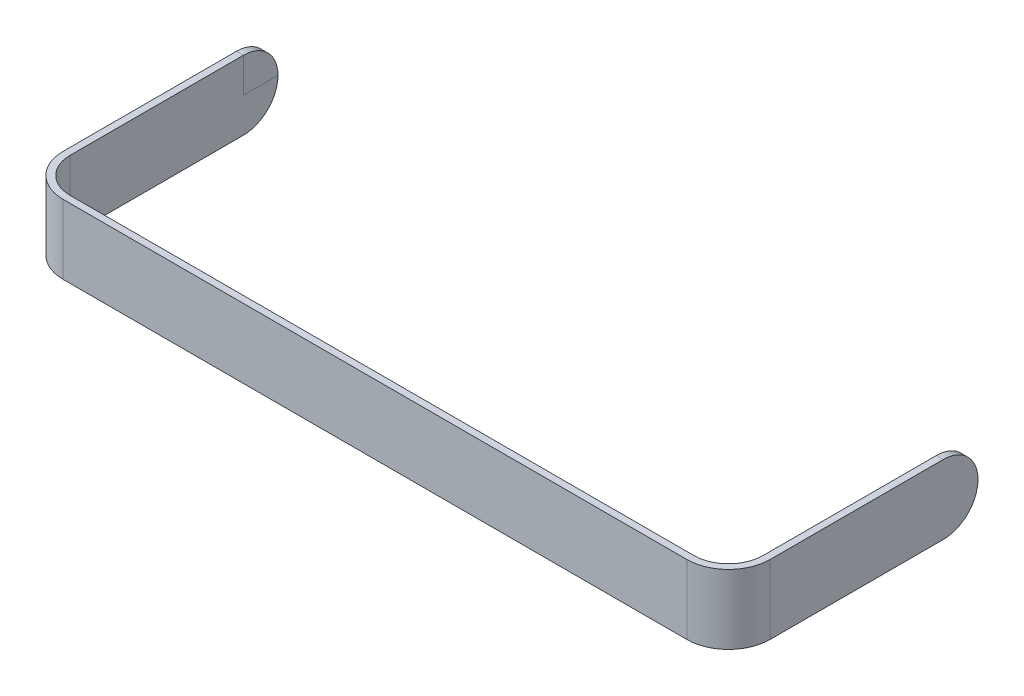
ISO-10303-21;
HEADER;
FILE_DESCRIPTION(('STEP AP214'),'2;1');
FILE_NAME('part.step','',(''),(''),'','','');
FILE_SCHEMA(('AUTOMOTIVE_DESIGN { 1 0 10303 214 1 1 1 1 }'));
ENDSEC;
DATA;
#1=APPLICATION_CONTEXT('core data for automotive mechanical design processes');
#2=APPLICATION_PROTOCOL_DEFINITION('international standard','automotive_design',2000,#1);
#3=PRODUCT_CONTEXT('',#1,'mechanical');
#4=PRODUCT('Part','Part','',(#3));
#5=PRODUCT_RELATED_PRODUCT_CATEGORY('part','',(#4));
#6=PRODUCT_DEFINITION_FORMATION('','',#4);
#7=PRODUCT_DEFINITION_CONTEXT('part definition',#1,'design');
#8=PRODUCT_DEFINITION('design','',#6,#7);
#9=PRODUCT_DEFINITION_SHAPE('','',#8);
#10=(LENGTH_UNIT() NAMED_UNIT(*) SI_UNIT(.MILLI.,.METRE.));
#11=(NAMED_UNIT(*) PLANE_ANGLE_UNIT() SI_UNIT($,.RADIAN.));
#12=(NAMED_UNIT(*) SI_UNIT($,.STERADIAN.) SOLID_ANGLE_UNIT());
#13=UNCERTAINTY_MEASURE_WITH_UNIT(LENGTH_MEASURE(1.E-05),#10,'distance_accuracy_value','');
#14=(GEOMETRIC_REPRESENTATION_CONTEXT(3) GLOBAL_UNCERTAINTY_ASSIGNED_CONTEXT((#13)) GLOBAL_UNIT_ASSIGNED_CONTEXT((#10,
#11,#12)) REPRESENTATION_CONTEXT('',''));
#15=CARTESIAN_POINT('',(0.,0.,0.));
#16=DIRECTION('',(0.,0.,1.));
#17=DIRECTION('',(1.,0.,0.));
#18=AXIS2_PLACEMENT_3D('',#15,#16,#17);
#19=CARTESIAN_POINT('',(-500.,50.,-50.));
#20=DIRECTION('',(-1.,0.,0.));
#21=DIRECTION('',(0.,0.,1.));
#22=AXIS2_PLACEMENT_3D('',#19,#20,#21);
#23=PLANE('',#22);
#24=DIRECTION('',(0.,0.,-1.));
#25=VECTOR('',#24,1.);
#26=CARTESIAN_POINT('',(-500.,0.,-50.));
#27=LINE('',#26,#25);
#28=CARTESIAN_POINT('',(-500.,0.,-300.));
#29=VERTEX_POINT('',#28);
#30=CARTESIAN_POINT('',(-500.,0.,-350.));
#31=VERTEX_POINT('',#30);
#32=EDGE_CURVE('E11',#29,#31,#27,.T.);
#33=ORIENTED_EDGE('',*,*,#32,.F.);
#34=DIRECTION('',(0.,-1.,0.));
#35=VECTOR('',#34,1.);
#36=CARTESIAN_POINT('',(-500.,50.,-300.));
#37=LINE('',#36,#35);
#38=CARTESIAN_POINT('',(-500.,50.,-300.));
#39=VERTEX_POINT('',#38);
#40=EDGE_CURVE('E40',#39,#29,#37,.T.);
#41=ORIENTED_EDGE('',*,*,#40,.F.);
#42=DIRECTION('',(0.,0.,-1.));
#43=VECTOR('',#42,1.);
#44=CARTESIAN_POINT('',(-500.,50.,-50.));
#45=LINE('',#44,#43);
#46=CARTESIAN_POINT('',(-500.,50.,-50.));
#47=VERTEX_POINT('',#46);
#48=EDGE_CURVE('E229',#47,#39,#45,.T.);
#49=ORIENTED_EDGE('',*,*,#48,.F.);
#50=DIRECTION('',(0.,-1.,0.));
#51=VECTOR('',#50,1.);
#52=CARTESIAN_POINT('',(-500.,50.,-50.));
#53=LINE('',#52,#51);
#54=CARTESIAN_POINT('',(-500.,-50.,-50.));
#55=VERTEX_POINT('',#54);
#56=EDGE_CURVE('E204',#47,#55,#53,.T.);
#57=ORIENTED_EDGE('',*,*,#56,.T.);
#58=DIRECTION('',(0.,0.,-1.));
#59=VECTOR('',#58,1.);
#60=CARTESIAN_POINT('',(-500.,-50.,-50.));
#61=LINE('',#60,#59);
#62=CARTESIAN_POINT('',(-500.,-50.,-300.));
#63=VERTEX_POINT('',#62);
#64=EDGE_CURVE('E176',#55,#63,#61,.T.);
#65=ORIENTED_EDGE('',*,*,#64,.T.);
#66=CARTESIAN_POINT('',(-500.,0.,-300.));
#67=DIRECTION('',(1.,0.,0.));
#68=DIRECTION('',(0.,0.,-1.));
#69=AXIS2_PLACEMENT_3D('',#66,#67,#68);
#70=CIRCLE('',#69,50.);
#71=EDGE_CURVE('E165',#63,#31,#70,.T.);
#72=ORIENTED_EDGE('',*,*,#71,.T.);
#73=EDGE_LOOP('',(#33,#41,#49,#57,#65,#72));
#74=FACE_BOUND('',#73,.T.);
#75=ADVANCED_FACE('F36',(#74),#23,.F.);
#76=CARTESIAN_POINT('',(500.,50.,-50.));
#77=DIRECTION('',(1.,0.,0.));
#78=DIRECTION('',(0.,0.,-1.));
#79=AXIS2_PLACEMENT_3D('',#76,#77,#78);
#80=PLANE('',#79);
#81=DIRECTION('',(0.,0.,1.));
#82=VECTOR('',#81,1.);
#83=CARTESIAN_POINT('',(500.,0.,-50.));
#84=LINE('',#83,#82);
#85=CARTESIAN_POINT('',(500.,0.,-350.));
#86=VERTEX_POINT('',#85);
#87=CARTESIAN_POINT('',(500.,0.,-300.));
#88=VERTEX_POINT('',#87);
#89=EDGE_CURVE('E141',#86,#88,#84,.T.);
#90=ORIENTED_EDGE('',*,*,#89,.F.);
#91=CARTESIAN_POINT('',(500.,0.,-300.));
#92=DIRECTION('',(-1.,0.,0.));
#93=DIRECTION('',(0.,0.,1.));
#94=AXIS2_PLACEMENT_3D('',#91,#92,#93);
#95=CIRCLE('',#94,50.);
#96=CARTESIAN_POINT('',(500.,-50.,-300.));
#97=VERTEX_POINT('',#96);
#98=EDGE_CURVE('E134',#86,#97,#95,.T.);
#99=ORIENTED_EDGE('',*,*,#98,.T.);
#100=DIRECTION('',(0.,0.,1.));
#101=VECTOR('',#100,1.);
#102=CARTESIAN_POINT('',(500.,-50.,-50.));
#103=LINE('',#102,#101);
#104=CARTESIAN_POINT('',(500.,-50.,-50.));
#105=VERTEX_POINT('',#104);
#106=EDGE_CURVE('E138',#97,#105,#103,.T.);
#107=ORIENTED_EDGE('',*,*,#106,.T.);
#108=DIRECTION('',(0.,-1.,0.));
#109=VECTOR('',#108,1.);
#110=CARTESIAN_POINT('',(500.,50.,-50.));
#111=LINE('',#110,#109);
#112=CARTESIAN_POINT('',(500.,50.,-50.));
#113=VERTEX_POINT('',#112);
#114=EDGE_CURVE('E213',#113,#105,#111,.T.);
#115=ORIENTED_EDGE('',*,*,#114,.F.);
#116=DIRECTION('',(0.,0.,1.));
#117=VECTOR('',#116,1.);
#118=CARTESIAN_POINT('',(500.,50.,-50.));
#119=LINE('',#118,#117);
#120=CARTESIAN_POINT('',(500.,50.,-300.));
#121=VERTEX_POINT('',#120);
#122=EDGE_CURVE('E256',#121,#113,#119,.T.);
#123=ORIENTED_EDGE('',*,*,#122,.F.);
#124=DIRECTION('',(0.,1.,0.));
#125=VECTOR('',#124,1.);
#126=CARTESIAN_POINT('',(500.,50.,-300.));
#127=LINE('',#126,#125);
#128=EDGE_CURVE('E215',#88,#121,#127,.T.);
#129=ORIENTED_EDGE('',*,*,#128,.F.);
#130=EDGE_LOOP('',(#90,#99,#107,#115,#123,#129));
#131=FACE_BOUND('',#130,.T.);
#132=ADVANCED_FACE('F136',(#131),#80,.F.);
#133=EDGE_CURVE('E146',#121,#86,#95,.T.);
#134=ORIENTED_EDGE('',*,*,#133,.T.);
#135=ORIENTED_EDGE('',*,*,#89,.T.);
#136=ORIENTED_EDGE('',*,*,#128,.T.);
#137=EDGE_LOOP('',(#134,#135,#136));
#138=FACE_BOUND('',#137,.T.);
#139=ADVANCED_FACE('F38',(#138),#80,.F.);
#140=CARTESIAN_POINT('',(450.,50.,-50.));
#141=DIRECTION('',(0.,-1.,0.));
#142=DIRECTION('',(0.,0.,-1.));
#143=AXIS2_PLACEMENT_3D('',#140,#141,#142);
#144=CYLINDRICAL_SURFACE('',#143,50.);
#145=CARTESIAN_POINT('',(450.,-50.,-50.));
#146=DIRECTION('',(0.,-1.,0.));
#147=DIRECTION('',(0.,0.,-1.));
#148=AXIS2_PLACEMENT_3D('',#145,#146,#147);
#149=CIRCLE('',#148,50.);
#150=CARTESIAN_POINT('',(450.,-50.,0.));
#151=VERTEX_POINT('',#150);
#152=EDGE_CURVE('E156',#105,#151,#149,.T.);
#153=ORIENTED_EDGE('',*,*,#152,.T.);
#154=DIRECTION('',(0.,-1.,0.));
#155=VECTOR('',#154,1.);
#156=CARTESIAN_POINT('',(450.,50.,0.));
#157=LINE('',#156,#155);
#158=CARTESIAN_POINT('',(450.,50.,0.));
#159=VERTEX_POINT('',#158);
#160=EDGE_CURVE('E210',#159,#151,#157,.T.);
#161=ORIENTED_EDGE('',*,*,#160,.F.);
#162=CARTESIAN_POINT('',(450.,50.,-50.));
#163=DIRECTION('',(0.,-1.,0.));
#164=DIRECTION('',(0.,0.,-1.));
#165=AXIS2_PLACEMENT_3D('',#162,#163,#164);
#166=CIRCLE('',#165,50.);
#167=EDGE_CURVE('E258',#113,#159,#166,.T.);
#168=ORIENTED_EDGE('',*,*,#167,.F.);
#169=ORIENTED_EDGE('',*,*,#114,.T.);
#170=EDGE_LOOP('',(#153,#161,#168,#169));
#171=FACE_BOUND('',#170,.T.);
#172=ADVANCED_FACE('F317',(#171),#144,.F.);
#173=CARTESIAN_POINT('',(-450.,50.,0.));
#174=DIRECTION('',(0.,0.,1.));
#175=DIRECTION('',(1.,0.,0.));
#176=AXIS2_PLACEMENT_3D('',#173,#174,#175);
#177=PLANE('',#176);
#178=DIRECTION('',(-1.,0.,0.));
#179=VECTOR('',#178,1.);
#180=CARTESIAN_POINT('',(-450.,-50.,0.));
#181=LINE('',#180,#179);
#182=CARTESIAN_POINT('',(-450.,-50.,0.));
#183=VERTEX_POINT('',#182);
#184=EDGE_CURVE('E172',#151,#183,#181,.T.);
#185=ORIENTED_EDGE('',*,*,#184,.T.);
#186=DIRECTION('',(0.,-1.,0.));
#187=VECTOR('',#186,1.);
#188=CARTESIAN_POINT('',(-450.,50.,0.));
#189=LINE('',#188,#187);
#190=CARTESIAN_POINT('',(-450.,50.,0.));
#191=VERTEX_POINT('',#190);
#192=EDGE_CURVE('E207',#191,#183,#189,.T.);
#193=ORIENTED_EDGE('',*,*,#192,.F.);
#194=DIRECTION('',(-1.,0.,0.));
#195=VECTOR('',#194,1.);
#196=CARTESIAN_POINT('',(-450.,50.,0.));
#197=LINE('',#196,#195);
#198=EDGE_CURVE('E239',#159,#191,#197,.T.);
#199=ORIENTED_EDGE('',*,*,#198,.F.);
#200=ORIENTED_EDGE('',*,*,#160,.T.);
#201=EDGE_LOOP('',(#185,#193,#199,#200));
#202=FACE_BOUND('',#201,.T.);
#203=ADVANCED_FACE('F268',(#202),#177,.F.);
#204=CARTESIAN_POINT('',(-450.,50.,-50.));
#205=DIRECTION('',(0.,-1.,0.));
#206=DIRECTION('',(0.,0.,-1.));
#207=AXIS2_PLACEMENT_3D('',#204,#205,#206);
#208=CYLINDRICAL_SURFACE('',#207,50.);
#209=CARTESIAN_POINT('',(-450.,-50.,-50.));
#210=DIRECTION('',(0.,-1.,0.));
#211=DIRECTION('',(0.,0.,-1.));
#212=AXIS2_PLACEMENT_3D('',#209,#210,#211);
#213=CIRCLE('',#212,50.);
#214=EDGE_CURVE('E174',#183,#55,#213,.T.);
#215=ORIENTED_EDGE('',*,*,#214,.T.);
#216=ORIENTED_EDGE('',*,*,#56,.F.);
#217=CARTESIAN_POINT('',(-450.,50.,-50.));
#218=DIRECTION('',(0.,-1.,0.));
#219=DIRECTION('',(0.,0.,-1.));
#220=AXIS2_PLACEMENT_3D('',#217,#218,#219);
#221=CIRCLE('',#220,50.);
#222=EDGE_CURVE('E235',#191,#47,#221,.T.);
#223=ORIENTED_EDGE('',*,*,#222,.F.);
#224=ORIENTED_EDGE('',*,*,#192,.T.);
#225=EDGE_LOOP('',(#215,#216,#223,#224));
#226=FACE_BOUND('',#225,.T.);
#227=ADVANCED_FACE('F271',(#226),#208,.F.);
#228=ORIENTED_EDGE('',*,*,#40,.T.);
#229=ORIENTED_EDGE('',*,*,#32,.T.);
#230=EDGE_CURVE('E226',#31,#39,#70,.T.);
#231=ORIENTED_EDGE('',*,*,#230,.T.);
#232=EDGE_LOOP('',(#228,#229,#231));
#233=FACE_BOUND('',#232,.T.);
#234=ADVANCED_FACE('F225',(#233),#23,.F.);
#235=CARTESIAN_POINT('',(-510.,50.,-50.));
#236=DIRECTION('',(1.,0.,0.));
#237=DIRECTION('',(0.,0.,-1.));
#238=AXIS2_PLACEMENT_3D('',#235,#236,#237);
#239=PLANE('',#238);
#240=DIRECTION('',(0.,0.,1.));
#241=VECTOR('',#240,1.);
#242=CARTESIAN_POINT('',(-510.,-50.,-50.));
#243=LINE('',#242,#241);
#244=CARTESIAN_POINT('',(-510.,-50.,-300.));
#245=VERTEX_POINT('',#244);
#246=CARTESIAN_POINT('',(-510.,-50.,-50.));
#247=VERTEX_POINT('',#246);
#248=EDGE_CURVE('E181',#245,#247,#243,.T.);
#249=ORIENTED_EDGE('',*,*,#248,.T.);
#250=DIRECTION('',(0.,-1.,0.));
#251=VECTOR('',#250,1.);
#252=CARTESIAN_POINT('',(-510.,50.,-50.));
#253=LINE('',#252,#251);
#254=CARTESIAN_POINT('',(-510.,50.,-50.));
#255=VERTEX_POINT('',#254);
#256=EDGE_CURVE('E201',#255,#247,#253,.T.);
#257=ORIENTED_EDGE('',*,*,#256,.F.);
#258=DIRECTION('',(0.,0.,1.));
#259=VECTOR('',#258,1.);
#260=CARTESIAN_POINT('',(-510.,50.,-50.));
#261=LINE('',#260,#259);
#262=CARTESIAN_POINT('',(-510.,50.,-300.));
#263=VERTEX_POINT('',#262);
#264=EDGE_CURVE('E237',#263,#255,#261,.T.);
#265=ORIENTED_EDGE('',*,*,#264,.F.);
#266=CARTESIAN_POINT('',(-510.,0.,-300.));
#267=DIRECTION('',(1.,0.,0.));
#268=DIRECTION('',(0.,0.,-1.));
#269=AXIS2_PLACEMENT_3D('',#266,#267,#268);
#270=CIRCLE('',#269,50.);
#271=EDGE_CURVE('E162',#263,#245,#270,.F.);
#272=ORIENTED_EDGE('',*,*,#271,.T.);
#273=EDGE_LOOP('',(#249,#257,#265,#272));
#274=FACE_BOUND('',#273,.T.);
#275=ADVANCED_FACE('F280',(#274),#239,.F.);
#276=CARTESIAN_POINT('',(-450.,50.,-50.));
#277=DIRECTION('',(0.,-1.,0.));
#278=DIRECTION('',(0.,0.,-1.));
#279=AXIS2_PLACEMENT_3D('',#276,#277,#278);
#280=CYLINDRICAL_SURFACE('',#279,59.9999999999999);
#281=CARTESIAN_POINT('',(-450.,-50.,-50.));
#282=DIRECTION('',(0.,1.,0.));
#283=DIRECTION('',(0.,0.,-1.));
#284=AXIS2_PLACEMENT_3D('',#281,#282,#283);
#285=CIRCLE('',#284,59.9999999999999);
#286=CARTESIAN_POINT('',(-450.,-50.,9.99999999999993));
#287=VERTEX_POINT('',#286);
#288=EDGE_CURVE('E183',#247,#287,#285,.T.);
#289=ORIENTED_EDGE('',*,*,#288,.T.);
#290=DIRECTION('',(0.,-1.,0.));
#291=VECTOR('',#290,1.);
#292=CARTESIAN_POINT('',(-450.,50.,9.99999999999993));
#293=LINE('',#292,#291);
#294=CARTESIAN_POINT('',(-450.,50.,9.99999999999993));
#295=VERTEX_POINT('',#294);
#296=EDGE_CURVE('E198',#295,#287,#293,.T.);
#297=ORIENTED_EDGE('',*,*,#296,.F.);
#298=CARTESIAN_POINT('',(-450.,50.,-50.));
#299=DIRECTION('',(0.,1.,0.));
#300=DIRECTION('',(0.,0.,-1.));
#301=AXIS2_PLACEMENT_3D('',#298,#299,#300);
#302=CIRCLE('',#301,59.9999999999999);
#303=EDGE_CURVE('E244',#255,#295,#302,.T.);
#304=ORIENTED_EDGE('',*,*,#303,.F.);
#305=ORIENTED_EDGE('',*,*,#256,.T.);
#306=EDGE_LOOP('',(#289,#297,#304,#305));
#307=FACE_BOUND('',#306,.T.);
#308=ADVANCED_FACE('F285',(#307),#280,.T.);
#309=CARTESIAN_POINT('',(-450.,50.,9.99999999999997));
#310=DIRECTION('',(0.,0.,-1.));
#311=DIRECTION('',(-1.,0.,0.));
#312=AXIS2_PLACEMENT_3D('',#309,#310,#311);
#313=PLANE('',#312);
#314=DIRECTION('',(1.,0.,0.));
#315=VECTOR('',#314,1.);
#316=CARTESIAN_POINT('',(-450.,-50.,9.99999999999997));
#317=LINE('',#316,#315);
#318=CARTESIAN_POINT('',(450.,-50.,10.));
#319=VERTEX_POINT('',#318);
#320=EDGE_CURVE('E185',#287,#319,#317,.T.);
#321=ORIENTED_EDGE('',*,*,#320,.T.);
#322=DIRECTION('',(0.,-1.,0.));
#323=VECTOR('',#322,1.);
#324=CARTESIAN_POINT('',(450.,50.,10.));
#325=LINE('',#324,#323);
#326=CARTESIAN_POINT('',(450.,50.,10.));
#327=VERTEX_POINT('',#326);
#328=EDGE_CURVE('E195',#327,#319,#325,.T.);
#329=ORIENTED_EDGE('',*,*,#328,.F.);
#330=DIRECTION('',(1.,0.,0.));
#331=VECTOR('',#330,1.);
#332=CARTESIAN_POINT('',(-450.,50.,9.99999999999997));
#333=LINE('',#332,#331);
#334=EDGE_CURVE('E246',#295,#327,#333,.T.);
#335=ORIENTED_EDGE('',*,*,#334,.F.);
#336=ORIENTED_EDGE('',*,*,#296,.T.);
#337=EDGE_LOOP('',(#321,#329,#335,#336));
#338=FACE_BOUND('',#337,.T.);
#339=ADVANCED_FACE('F289',(#338),#313,.F.);
#340=CARTESIAN_POINT('',(450.,50.,-50.));
#341=DIRECTION('',(0.,-1.,0.));
#342=DIRECTION('',(0.,0.,-1.));
#343=AXIS2_PLACEMENT_3D('',#340,#341,#342);
#344=CYLINDRICAL_SURFACE('',#343,60.);
#345=CARTESIAN_POINT('',(450.,-50.,-50.));
#346=DIRECTION('',(0.,1.,0.));
#347=DIRECTION('',(0.,0.,-1.));
#348=AXIS2_PLACEMENT_3D('',#345,#346,#347);
#349=CIRCLE('',#348,60.);
#350=CARTESIAN_POINT('',(510.,-50.,-50.));
#351=VERTEX_POINT('',#350);
#352=EDGE_CURVE('E187',#319,#351,#349,.T.);
#353=ORIENTED_EDGE('',*,*,#352,.T.);
#354=DIRECTION('',(0.,-1.,0.));
#355=VECTOR('',#354,1.);
#356=CARTESIAN_POINT('',(510.,50.,-50.));
#357=LINE('',#356,#355);
#358=CARTESIAN_POINT('',(510.,50.,-50.));
#359=VERTEX_POINT('',#358);
#360=EDGE_CURVE('E192',#359,#351,#357,.T.);
#361=ORIENTED_EDGE('',*,*,#360,.F.);
#362=CARTESIAN_POINT('',(450.,50.,-50.));
#363=DIRECTION('',(0.,1.,0.));
#364=DIRECTION('',(0.,0.,-1.));
#365=AXIS2_PLACEMENT_3D('',#362,#363,#364);
#366=CIRCLE('',#365,60.);
#367=EDGE_CURVE('E247',#327,#359,#366,.T.);
#368=ORIENTED_EDGE('',*,*,#367,.F.);
#369=ORIENTED_EDGE('',*,*,#328,.T.);
#370=EDGE_LOOP('',(#353,#361,#368,#369));
#371=FACE_BOUND('',#370,.T.);
#372=ADVANCED_FACE('F293',(#371),#344,.T.);
#373=CARTESIAN_POINT('',(510.,50.,-50.));
#374=DIRECTION('',(-1.,0.,0.));
#375=DIRECTION('',(0.,0.,1.));
#376=AXIS2_PLACEMENT_3D('',#373,#374,#375);
#377=PLANE('',#376);
#378=DIRECTION('',(0.,0.,-1.));
#379=VECTOR('',#378,1.);
#380=CARTESIAN_POINT('',(510.,-50.,-50.));
#381=LINE('',#380,#379);
#382=CARTESIAN_POINT('',(510.,-50.,-300.));
#383=VERTEX_POINT('',#382);
#384=EDGE_CURVE('E189',#351,#383,#381,.T.);
#385=ORIENTED_EDGE('',*,*,#384,.T.);
#386=CARTESIAN_POINT('',(510.,0.,-300.));
#387=DIRECTION('',(-1.,0.,0.));
#388=DIRECTION('',(0.,0.,1.));
#389=AXIS2_PLACEMENT_3D('',#386,#387,#388);
#390=CIRCLE('',#389,50.);
#391=CARTESIAN_POINT('',(510.,50.,-300.));
#392=VERTEX_POINT('',#391);
#393=EDGE_CURVE('E161',#383,#392,#390,.F.);
#394=ORIENTED_EDGE('',*,*,#393,.T.);
#395=DIRECTION('',(0.,0.,-1.));
#396=VECTOR('',#395,1.);
#397=CARTESIAN_POINT('',(510.,50.,-50.));
#398=LINE('',#397,#396);
#399=EDGE_CURVE('E168',#359,#392,#398,.T.);
#400=ORIENTED_EDGE('',*,*,#399,.F.);
#401=ORIENTED_EDGE('',*,*,#360,.T.);
#402=EDGE_LOOP('',(#385,#394,#400,#401));
#403=FACE_BOUND('',#402,.T.);
#404=ADVANCED_FACE('F254',(#403),#377,.F.);
#405=CARTESIAN_POINT('',(450.,50.,-50.));
#406=DIRECTION('',(0.,-1.,0.));
#407=DIRECTION('',(0.,0.,-1.));
#408=AXIS2_PLACEMENT_3D('',#405,#406,#407);
#409=PLANE('',#408);
#410=DIRECTION('',(-1.,0.,0.));
#411=VECTOR('',#410,1.);
#412=CARTESIAN_POINT('',(500.,50.,-300.));
#413=LINE('',#412,#411);
#414=EDGE_CURVE('E191',#392,#121,#413,.T.);
#415=ORIENTED_EDGE('',*,*,#414,.T.);
#416=ORIENTED_EDGE('',*,*,#122,.T.);
#417=ORIENTED_EDGE('',*,*,#167,.T.);
#418=ORIENTED_EDGE('',*,*,#198,.T.);
#419=ORIENTED_EDGE('',*,*,#222,.T.);
#420=ORIENTED_EDGE('',*,*,#48,.T.);
#421=DIRECTION('',(-1.,0.,0.));
#422=VECTOR('',#421,1.);
#423=CARTESIAN_POINT('',(-510.,50.,-300.));
#424=LINE('',#423,#422);
#425=EDGE_CURVE('E234',#39,#263,#424,.T.);
#426=ORIENTED_EDGE('',*,*,#425,.T.);
#427=ORIENTED_EDGE('',*,*,#264,.T.);
#428=ORIENTED_EDGE('',*,*,#303,.T.);
#429=ORIENTED_EDGE('',*,*,#334,.T.);
#430=ORIENTED_EDGE('',*,*,#367,.T.);
#431=ORIENTED_EDGE('',*,*,#399,.T.);
#432=EDGE_LOOP('',(#415,#416,#417,#418,#419,#420,#426,#427,#428,#429,#430,#431));
#433=FACE_BOUND('',#432,.T.);
#434=ADVANCED_FACE('F252',(#433),#409,.F.);
#435=CARTESIAN_POINT('',(450.,-50.,-50.));
#436=DIRECTION('',(0.,-1.,0.));
#437=DIRECTION('',(0.,0.,-1.));
#438=AXIS2_PLACEMENT_3D('',#435,#436,#437);
#439=PLANE('',#438);
#440=DIRECTION('',(-1.,0.,0.));
#441=VECTOR('',#440,1.);
#442=CARTESIAN_POINT('',(500.,-50.,-300.));
#443=LINE('',#442,#441);
#444=EDGE_CURVE('E153',#383,#97,#443,.T.);
#445=ORIENTED_EDGE('',*,*,#444,.F.);
#446=ORIENTED_EDGE('',*,*,#384,.F.);
#447=ORIENTED_EDGE('',*,*,#352,.F.);
#448=ORIENTED_EDGE('',*,*,#320,.F.);
#449=ORIENTED_EDGE('',*,*,#288,.F.);
#450=ORIENTED_EDGE('',*,*,#248,.F.);
#451=DIRECTION('',(-1.,0.,0.));
#452=VECTOR('',#451,1.);
#453=CARTESIAN_POINT('',(-510.,-50.,-300.));
#454=LINE('',#453,#452);
#455=EDGE_CURVE('E178',#63,#245,#454,.T.);
#456=ORIENTED_EDGE('',*,*,#455,.F.);
#457=ORIENTED_EDGE('',*,*,#64,.F.);
#458=ORIENTED_EDGE('',*,*,#214,.F.);
#459=ORIENTED_EDGE('',*,*,#184,.F.);
#460=ORIENTED_EDGE('',*,*,#152,.F.);
#461=ORIENTED_EDGE('',*,*,#106,.F.);
#462=EDGE_LOOP('',(#445,#446,#447,#448,#449,#450,#456,#457,#458,#459,#460,#461));
#463=FACE_BOUND('',#462,.T.);
#464=ADVANCED_FACE('F151',(#463),#439,.T.);
#465=CARTESIAN_POINT('',(-621.803398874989,0.,-300.));
#466=DIRECTION('',(1.,0.,0.));
#467=DIRECTION('',(0.,0.,-1.));
#468=AXIS2_PLACEMENT_3D('',#465,#466,#467);
#469=CYLINDRICAL_SURFACE('',#468,50.);
#470=ORIENTED_EDGE('',*,*,#271,.F.);
#471=ORIENTED_EDGE('',*,*,#425,.F.);
#472=ORIENTED_EDGE('',*,*,#230,.F.);
#473=ORIENTED_EDGE('',*,*,#71,.F.);
#474=ORIENTED_EDGE('',*,*,#455,.T.);
#475=EDGE_LOOP('',(#470,#471,#472,#473,#474));
#476=FACE_BOUND('',#475,.T.);
#477=ADVANCED_FACE('F276',(#476),#469,.T.);
#478=CARTESIAN_POINT('',(621.803398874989,0.,-300.));
#479=DIRECTION('',(-1.,0.,0.));
#480=DIRECTION('',(0.,0.,1.));
#481=AXIS2_PLACEMENT_3D('',#478,#479,#480);
#482=CYLINDRICAL_SURFACE('',#481,50.);
#483=ORIENTED_EDGE('',*,*,#393,.F.);
#484=ORIENTED_EDGE('',*,*,#444,.T.);
#485=ORIENTED_EDGE('',*,*,#98,.F.);
#486=ORIENTED_EDGE('',*,*,#133,.F.);
#487=ORIENTED_EDGE('',*,*,#414,.F.);
#488=EDGE_LOOP('',(#483,#484,#485,#486,#487));
#489=FACE_BOUND('',#488,.T.);
#490=ADVANCED_FACE('F158',(#489),#482,.T.);
#491=CLOSED_SHELL('',(#75,#132,#139,#172,#203,#227,#234,#275,#308,#339,#372,#404,#434,#464,#477,#490));
#492=MANIFOLD_SOLID_BREP('B2',#491);
#493=ADVANCED_BREP_SHAPE_REPRESENTATION('',(#18,#492),#14);
#494=SHAPE_DEFINITION_REPRESENTATION(#9,#493);
ENDSEC;
END-ISO-10303-21;
